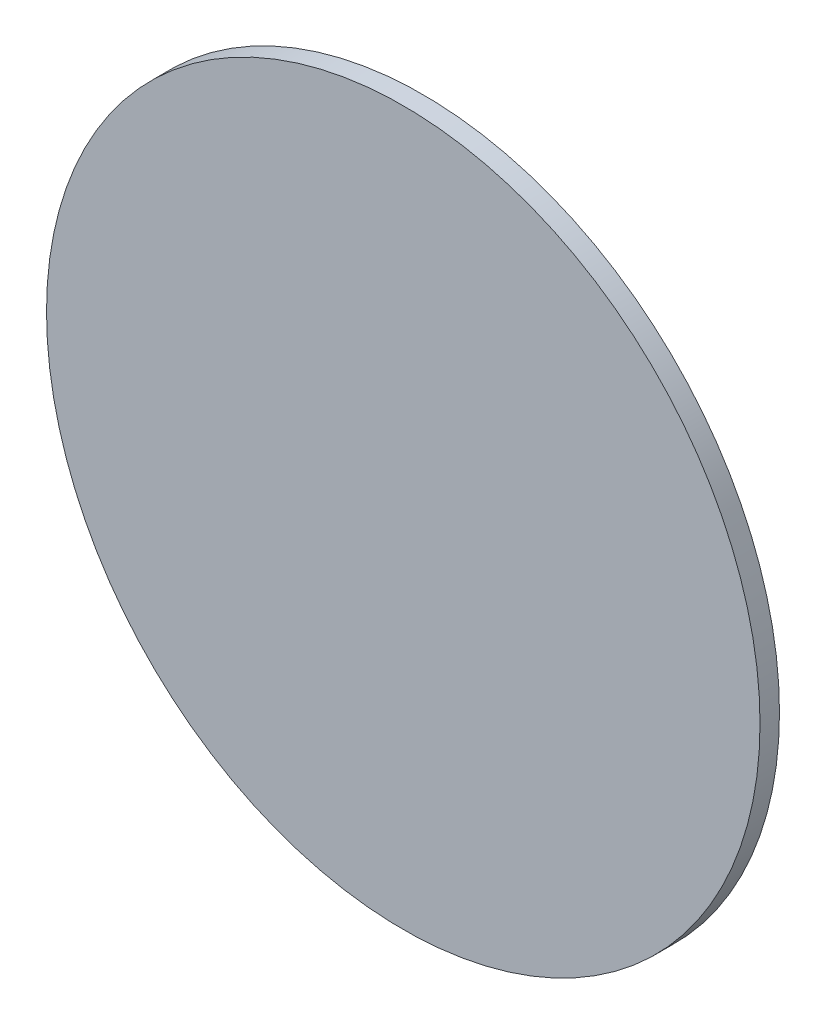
ISO-10303-21;
HEADER;
FILE_DESCRIPTION(('STEP AP214'),'2;1');
FILE_NAME('part.step','',(''),(''),'','','');
FILE_SCHEMA(('AUTOMOTIVE_DESIGN { 1 0 10303 214 1 1 1 1 }'));
ENDSEC;
DATA;
#1=APPLICATION_CONTEXT('core data for automotive mechanical design processes');
#2=APPLICATION_PROTOCOL_DEFINITION('international standard','automotive_design',2000,#1);
#3=PRODUCT_CONTEXT('',#1,'mechanical');
#4=PRODUCT('Part','Part','',(#3));
#5=PRODUCT_RELATED_PRODUCT_CATEGORY('part','',(#4));
#6=PRODUCT_DEFINITION_FORMATION('','',#4);
#7=PRODUCT_DEFINITION_CONTEXT('part definition',#1,'design');
#8=PRODUCT_DEFINITION('design','',#6,#7);
#9=PRODUCT_DEFINITION_SHAPE('','',#8);
#10=(LENGTH_UNIT() NAMED_UNIT(*) SI_UNIT(.MILLI.,.METRE.));
#11=(NAMED_UNIT(*) PLANE_ANGLE_UNIT() SI_UNIT($,.RADIAN.));
#12=(NAMED_UNIT(*) SI_UNIT($,.STERADIAN.) SOLID_ANGLE_UNIT());
#13=UNCERTAINTY_MEASURE_WITH_UNIT(LENGTH_MEASURE(1.E-05),#10,'distance_accuracy_value','');
#14=(GEOMETRIC_REPRESENTATION_CONTEXT(3) GLOBAL_UNCERTAINTY_ASSIGNED_CONTEXT((#13)) GLOBAL_UNIT_ASSIGNED_CONTEXT((#10,
#11,#12)) REPRESENTATION_CONTEXT('',''));
#15=CARTESIAN_POINT('',(0.,0.,0.));
#16=DIRECTION('',(0.,0.,1.));
#17=DIRECTION('',(1.,0.,0.));
#18=AXIS2_PLACEMENT_3D('',#15,#16,#17);
#19=CARTESIAN_POINT('',(0.597067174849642,-0.604942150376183,3.));
#20=DIRECTION('',(0.,0.,-1.));
#21=DIRECTION('',(-1.,0.,0.));
#22=AXIS2_PLACEMENT_3D('',#19,#20,#21);
#23=CYLINDRICAL_SURFACE('',#22,55.);
#24=CARTESIAN_POINT('',(0.597067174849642,-0.604942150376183,3.));
#25=DIRECTION('',(0.,0.,1.));
#26=DIRECTION('',(1.,0.,0.));
#27=AXIS2_PLACEMENT_3D('',#24,#25,#26);
#28=CIRCLE('',#27,55.);
#29=CARTESIAN_POINT('',(55.5970671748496,-0.604942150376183,3.));
#30=VERTEX_POINT('',#29);
#31=EDGE_CURVE('E10',#30,#30,#28,.T.);
#32=ORIENTED_EDGE('',*,*,#31,.F.);
#33=EDGE_LOOP('',(#32));
#34=FACE_BOUND('',#33,.T.);
#35=CARTESIAN_POINT('',(0.597067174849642,-0.604942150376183,0.));
#36=DIRECTION('',(0.,0.,1.));
#37=DIRECTION('',(1.,0.,0.));
#38=AXIS2_PLACEMENT_3D('',#35,#36,#37);
#39=CIRCLE('',#38,55.);
#40=CARTESIAN_POINT('',(55.5970671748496,-0.604942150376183,0.));
#41=VERTEX_POINT('',#40);
#42=EDGE_CURVE('E34',#41,#41,#39,.T.);
#43=ORIENTED_EDGE('',*,*,#42,.T.);
#44=EDGE_LOOP('',(#43));
#45=FACE_BOUND('',#44,.T.);
#46=ADVANCED_FACE('F31',(#34,#45),#23,.T.);
#47=CARTESIAN_POINT('',(0.597067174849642,-0.604942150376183,3.));
#48=DIRECTION('',(0.,0.,1.));
#49=DIRECTION('',(1.,0.,0.));
#50=AXIS2_PLACEMENT_3D('',#47,#48,#49);
#51=PLANE('',#50);
#52=ORIENTED_EDGE('',*,*,#31,.T.);
#53=EDGE_LOOP('',(#52));
#54=FACE_BOUND('',#53,.T.);
#55=ADVANCED_FACE('F46',(#54),#51,.T.);
#56=CARTESIAN_POINT('',(0.597067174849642,-0.604942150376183,0.));
#57=DIRECTION('',(0.,0.,1.));
#58=DIRECTION('',(1.,0.,0.));
#59=AXIS2_PLACEMENT_3D('',#56,#57,#58);
#60=PLANE('',#59);
#61=ORIENTED_EDGE('',*,*,#42,.F.);
#62=EDGE_LOOP('',(#61));
#63=FACE_BOUND('',#62,.T.);
#64=ADVANCED_FACE('F44',(#63),#60,.F.);
#65=CLOSED_SHELL('',(#46,#55,#64));
#66=MANIFOLD_SOLID_BREP('B2',#65);
#67=ADVANCED_BREP_SHAPE_REPRESENTATION('',(#18,#66),#14);
#68=SHAPE_DEFINITION_REPRESENTATION(#9,#67);
ENDSEC;
END-ISO-10303-21;
